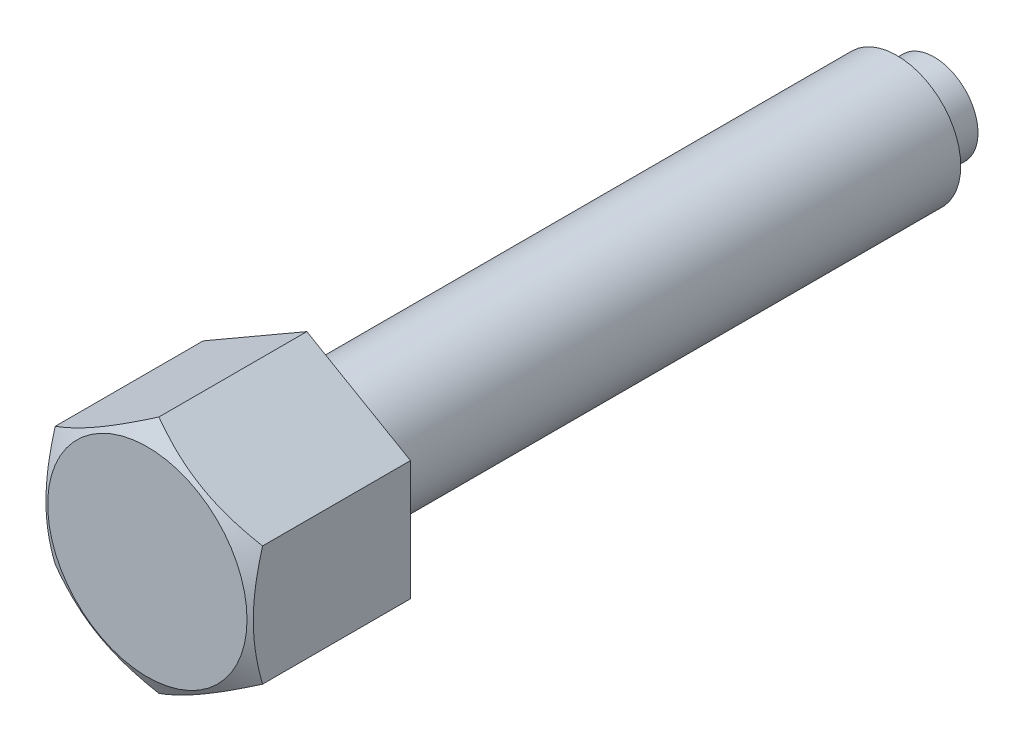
ISO-10303-21;
HEADER;
FILE_DESCRIPTION(('STEP AP214'),'2;1');
FILE_NAME('part.step','',(''),(''),'','','');
FILE_SCHEMA(('AUTOMOTIVE_DESIGN { 1 0 10303 214 1 1 1 1 }'));
ENDSEC;
DATA;
#1=APPLICATION_CONTEXT('core data for automotive mechanical design processes');
#2=APPLICATION_PROTOCOL_DEFINITION('international standard','automotive_design',2000,#1);
#3=PRODUCT_CONTEXT('',#1,'mechanical');
#4=PRODUCT('Part','Part','',(#3));
#5=PRODUCT_RELATED_PRODUCT_CATEGORY('part','',(#4));
#6=PRODUCT_DEFINITION_FORMATION('','',#4);
#7=PRODUCT_DEFINITION_CONTEXT('part definition',#1,'design');
#8=PRODUCT_DEFINITION('design','',#6,#7);
#9=PRODUCT_DEFINITION_SHAPE('','',#8);
#10=(LENGTH_UNIT() NAMED_UNIT(*) SI_UNIT(.MILLI.,.METRE.));
#11=(NAMED_UNIT(*) PLANE_ANGLE_UNIT() SI_UNIT($,.RADIAN.));
#12=(NAMED_UNIT(*) SI_UNIT($,.STERADIAN.) SOLID_ANGLE_UNIT());
#13=UNCERTAINTY_MEASURE_WITH_UNIT(LENGTH_MEASURE(1.E-05),#10,'distance_accuracy_value','');
#14=(GEOMETRIC_REPRESENTATION_CONTEXT(3) GLOBAL_UNCERTAINTY_ASSIGNED_CONTEXT((#13)) GLOBAL_UNIT_ASSIGNED_CONTEXT((#10,
#11,#12)) REPRESENTATION_CONTEXT('',''));
#15=CARTESIAN_POINT('',(0.,0.,0.));
#16=DIRECTION('',(0.,0.,1.));
#17=DIRECTION('',(1.,0.,0.));
#18=AXIS2_PLACEMENT_3D('',#15,#16,#17);
#19=CARTESIAN_POINT('',(0.,7.50555349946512,38.));
#20=DIRECTION('',(-0.5,-0.86602540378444,0.));
#21=DIRECTION('',(0.86602540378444,-0.5,0.));
#22=AXIS2_PLACEMENT_3D('',#19,#20,#21);
#23=PLANE('',#22);
#24=CARTESIAN_POINT('',(6.5002,3.75266127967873,49.2750391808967));
#25=CARTESIAN_POINT('',(6.35732254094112,3.8351516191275,49.3226580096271));
#26=CARTESIAN_POINT('',(6.21391236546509,3.91794952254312,49.3681157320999));
#27=CARTESIAN_POINT('',(5.92592736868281,4.08421773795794,49.4541137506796));
#28=CARTESIAN_POINT('',(5.78135207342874,4.16768832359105,49.4946519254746));
#29=CARTESIAN_POINT('',(5.34531134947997,4.41943655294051,49.6080914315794));
#30=CARTESIAN_POINT('',(5.05212471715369,4.58870793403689,49.6726146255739));
#31=CARTESIAN_POINT('',(4.61337625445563,4.84201947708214,49.7482758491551));
#32=CARTESIAN_POINT('',(4.46912536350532,4.92530276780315,49.7698295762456));
#33=CARTESIAN_POINT('',(4.17997178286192,5.09224566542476,49.8059721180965));
#34=CARTESIAN_POINT('',(4.03506915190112,5.17590523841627,49.8205615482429));
#35=CARTESIAN_POINT('',(3.74501222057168,5.34336968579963,49.8424036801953));
#36=CARTESIAN_POINT('',(3.59985839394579,5.42717428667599,49.8496647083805));
#37=CARTESIAN_POINT('',(3.30942466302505,5.59485627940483,49.8567021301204));
#38=CARTESIAN_POINT('',(3.16414476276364,5.6787336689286,49.8564787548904));
#39=CARTESIAN_POINT('',(2.76612405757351,5.90853103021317,49.8455789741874));
#40=CARTESIAN_POINT('',(2.51351353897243,6.05437578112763,49.8272806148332));
#41=CARTESIAN_POINT('',(2.00997032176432,6.34509659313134,49.7692560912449));
#42=CARTESIAN_POINT('',(1.75903939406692,6.48997163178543,49.7295100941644));
#43=CARTESIAN_POINT('',(1.25448277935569,6.78127752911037,49.6301565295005));
#44=CARTESIAN_POINT('',(1.0009207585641,6.92767163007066,49.5701280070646));
#45=CARTESIAN_POINT('',(0.497578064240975,7.21827667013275,49.4338874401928));
#46=CARTESIAN_POINT('',(0.247790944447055,7.36249133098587,49.357707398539));
#47=CARTESIAN_POINT('',(-0.000199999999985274,7.50566896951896,49.2750391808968));
#48=B_SPLINE_CURVE_WITH_KNOTS('',3,(#24,#25,#26,#27,#28,#29,#30,#31,#32,#33,#34,#35,#36,#37,#38,
#39,#40,#41,#42,#43,#44,#45,#46,#47),.UNSPECIFIED.,.F.,.F.,(4,2,2,2,2,2,2,2,2,2,2,4),(0.,
0.515105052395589,1.03043143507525,2.06322554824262,2.56697389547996,3.07067772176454,
3.57380860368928,4.07692394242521,4.9527935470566,5.82947446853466,6.72559912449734,
7.61996451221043),.UNSPECIFIED.);
#49=CARTESIAN_POINT('',(6.5,3.75277674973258,49.2751058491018));
#50=VERTEX_POINT('',#49);
#51=CARTESIAN_POINT('',(0.,7.50555349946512,49.2751058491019));
#52=VERTEX_POINT('',#51);
#53=EDGE_CURVE('E29',#50,#52,#48,.T.);
#54=ORIENTED_EDGE('',*,*,#53,.F.);
#55=DIRECTION('',(0.,0.,1.));
#56=VECTOR('',#55,1.);
#57=CARTESIAN_POINT('',(6.5,3.75277674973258,38.));
#58=LINE('',#57,#56);
#59=CARTESIAN_POINT('',(6.5,3.75277674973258,40.));
#60=VERTEX_POINT('',#59);
#61=EDGE_CURVE('E96',#60,#50,#58,.T.);
#62=ORIENTED_EDGE('',*,*,#61,.F.);
#63=DIRECTION('',(0.86602540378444,-0.5,0.));
#64=VECTOR('',#63,1.);
#65=CARTESIAN_POINT('',(6.25,3.89711431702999,40.));
#66=LINE('',#65,#64);
#67=CARTESIAN_POINT('',(0.,7.50555349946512,40.));
#68=VERTEX_POINT('',#67);
#69=EDGE_CURVE('E110',#68,#60,#66,.T.);
#70=ORIENTED_EDGE('',*,*,#69,.F.);
#71=DIRECTION('',(0.,0.,1.));
#72=VECTOR('',#71,1.);
#73=CARTESIAN_POINT('',(0.,7.50555349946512,38.));
#74=LINE('',#73,#72);
#75=EDGE_CURVE('E36',#68,#52,#74,.T.);
#76=ORIENTED_EDGE('',*,*,#75,.T.);
#77=EDGE_LOOP('',(#54,#62,#70,#76));
#78=FACE_BOUND('',#77,.T.);
#79=ADVANCED_FACE('F14',(#78),#23,.F.);
#80=CARTESIAN_POINT('',(6.5,3.75277674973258,38.));
#81=DIRECTION('',(-1.,0.,0.));
#82=DIRECTION('',(0.,-1.,0.));
#83=AXIS2_PLACEMENT_3D('',#80,#81,#82);
#84=PLANE('',#83);
#85=CARTESIAN_POINT('',(6.5,-10.0501735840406,46.6981572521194));
#86=CARTESIAN_POINT('',(6.5,-9.76652663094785,46.8356295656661));
#87=CARTESIAN_POINT('',(6.5,-9.48222527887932,46.9717749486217));
#88=CARTESIAN_POINT('',(6.5,-8.91196565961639,47.240664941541));
#89=CARTESIAN_POINT('',(6.5,-8.62600713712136,47.3734090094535));
#90=CARTESIAN_POINT('',(6.5,-8.05059717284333,47.6354237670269));
#91=CARTESIAN_POINT('',(6.5,-7.76113517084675,47.7646713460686));
#92=CARTESIAN_POINT('',(6.5,-7.17989822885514,48.0178366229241));
#93=CARTESIAN_POINT('',(6.5,-6.88812339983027,48.1417545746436));
#94=CARTESIAN_POINT('',(6.5,-6.29249929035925,48.3866756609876));
#95=CARTESIAN_POINT('',(6.5,-5.98856037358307,48.5074620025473));
#96=CARTESIAN_POINT('',(6.5,-5.37711520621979,48.7398195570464));
#97=CARTESIAN_POINT('',(6.5,-5.06960855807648,48.8513897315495));
#98=CARTESIAN_POINT('',(6.5,-4.45112530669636,49.0623641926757));
#99=CARTESIAN_POINT('',(6.5,-4.14015727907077,49.1617933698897));
#100=CARTESIAN_POINT('',(6.5,-3.51375753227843,49.3452742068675));
#101=CARTESIAN_POINT('',(6.5,-3.19832726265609,49.4293307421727));
#102=CARTESIAN_POINT('',(6.5,-2.56458296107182,49.5775713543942));
#103=CARTESIAN_POINT('',(6.5,-2.2462942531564,49.6418619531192));
#104=CARTESIAN_POINT('',(6.5,-1.60574569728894,49.7469001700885));
#105=CARTESIAN_POINT('',(6.5,-1.28348621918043,49.7876499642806));
#106=CARTESIAN_POINT('',(6.5,-0.800541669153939,49.8284124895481));
#107=CARTESIAN_POINT('',(6.5,-0.640675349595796,49.8386045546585));
#108=CARTESIAN_POINT('',(6.5,-0.320647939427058,49.8522269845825));
#109=CARTESIAN_POINT('',(6.5,-0.160486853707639,49.8556574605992));
#110=CARTESIAN_POINT('',(6.5,0.159835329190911,49.8556673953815));
#111=CARTESIAN_POINT('',(6.5,0.319996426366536,49.8522468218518));
#112=CARTESIAN_POINT('',(6.5,0.640033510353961,49.8386397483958));
#113=CARTESIAN_POINT('',(6.5,0.799909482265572,49.8284529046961));
#114=CARTESIAN_POINT('',(6.5,1.1850597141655,49.7959757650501));
#115=CARTESIAN_POINT('',(6.5,1.41006459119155,49.770423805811));
#116=CARTESIAN_POINT('',(6.5,1.85837391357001,49.7073182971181));
#117=CARTESIAN_POINT('',(6.5,2.08167811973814,49.6697630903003));
#118=CARTESIAN_POINT('',(6.5,2.74880133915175,49.5410865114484));
#119=CARTESIAN_POINT('',(6.5,3.18957588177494,49.4339785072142));
#120=CARTESIAN_POINT('',(6.5,3.84861504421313,49.2486258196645));
#121=CARTESIAN_POINT('',(6.5,4.07030760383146,49.1818718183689));
#122=CARTESIAN_POINT('',(6.5,4.51153880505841,49.0415258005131));
#123=CARTESIAN_POINT('',(6.5,4.73107743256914,48.9679337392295));
#124=CARTESIAN_POINT('',(6.5,5.16807170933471,48.815084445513));
#125=CARTESIAN_POINT('',(6.5,5.38552803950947,48.7358291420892));
#126=CARTESIAN_POINT('',(6.5,5.81864539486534,48.5725763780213));
#127=CARTESIAN_POINT('',(6.5,6.03430643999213,48.488578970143));
#128=CARTESIAN_POINT('',(6.5,6.53886111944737,48.2866902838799));
#129=CARTESIAN_POINT('',(6.5,6.8271062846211,48.1671814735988));
#130=CARTESIAN_POINT('',(6.5,7.40118486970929,47.9224889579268));
#131=CARTESIAN_POINT('',(6.5,7.68701814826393,47.7973049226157));
#132=CARTESIAN_POINT('',(6.5,8.25671090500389,47.5423894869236));
#133=CARTESIAN_POINT('',(6.5,8.54056998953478,47.4126572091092));
#134=CARTESIAN_POINT('',(6.5,9.10659576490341,47.1495453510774));
#135=CARTESIAN_POINT('',(6.5,9.38876242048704,47.0161656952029));
#136=CARTESIAN_POINT('',(6.5,9.9519638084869,46.7462996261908));
#137=CARTESIAN_POINT('',(6.5,10.2329970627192,46.6098101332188));
#138=CARTESIAN_POINT('',(6.5,10.7938615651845,46.3343812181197));
#139=CARTESIAN_POINT('',(6.5,11.0736928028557,46.1954417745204));
#140=CARTESIAN_POINT('',(6.5,11.9115962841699,45.7756296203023));
#141=CARTESIAN_POINT('',(6.5,12.4681508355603,45.4917280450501));
#142=CARTESIAN_POINT('',(6.5,13.5324754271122,44.9419038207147));
#143=CARTESIAN_POINT('',(6.5,14.0404794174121,44.6764320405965));
#144=CARTESIAN_POINT('',(6.5,15.0545974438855,44.141863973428));
#145=CARTESIAN_POINT('',(6.5,15.5607114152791,43.8727675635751));
#146=CARTESIAN_POINT('',(6.5,16.5702359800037,43.3324660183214));
#147=CARTESIAN_POINT('',(6.5,17.0736501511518,43.0612675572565));
#148=CARTESIAN_POINT('',(6.5,18.0792676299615,42.5166981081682));
#149=CARTESIAN_POINT('',(6.5,18.581471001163,42.2433272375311));
#150=CARTESIAN_POINT('',(6.5,19.0832274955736,41.9691440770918));
#151=B_SPLINE_CURVE_WITH_KNOTS('',3,(#85,#86,#87,#88,#89,#90,#91,#92,#93,#94,#95,#96,#97,#98,
#99,#100,#101,#102,#103,#104,#105,#106,#107,#108,#109,#110,#111,#112,#113,#114,#115,#116,#117,
#118,#119,#120,#121,#122,#123,#124,#125,#126,#127,#128,#129,#130,#131,#132,#133,#134,#135,#136,
#137,#138,#139,#140,#141,#142,#143,#144,#145,#146,#147,#148,#149,#150),.UNSPECIFIED.,.F.,.F.,(4,
2,2,2,2,2,2,2,2,2,2,2,2,2,2,2,2,2,2,2,2,2,2,2,2,2,2,2,2,2,2,2,4),(0.,0.945626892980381,
1.89140356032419,2.84238037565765,3.79331183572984,4.77437629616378,5.75555114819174,
6.73467943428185,7.71349664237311,8.6869424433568,9.66029825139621,10.1407496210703,
10.6211930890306,11.1016388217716,11.5821089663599,12.2610780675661,12.9401409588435,
14.2990319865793,14.9935493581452,15.6880712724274,16.3823577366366,17.0766364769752,
18.0126686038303,18.9487552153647,19.8850234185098,20.8213110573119,21.7585701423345,
22.6958374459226,24.5701304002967,26.2896757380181,28.0092794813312,29.7247241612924,
31.440076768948),.UNSPECIFIED.);
#152=CARTESIAN_POINT('',(6.5,-3.75277674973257,49.2751058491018));
#153=VERTEX_POINT('',#152);
#154=EDGE_CURVE('E156',#153,#50,#151,.T.);
#155=ORIENTED_EDGE('',*,*,#154,.F.);
#156=DIRECTION('',(0.,0.,1.));
#157=VECTOR('',#156,1.);
#158=CARTESIAN_POINT('',(6.5,-3.75277674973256,38.));
#159=LINE('',#158,#157);
#160=CARTESIAN_POINT('',(6.5,-3.75277674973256,40.));
#161=VERTEX_POINT('',#160);
#162=EDGE_CURVE('E93',#161,#153,#159,.T.);
#163=ORIENTED_EDGE('',*,*,#162,.F.);
#164=DIRECTION('',(0.,-1.,0.));
#165=VECTOR('',#164,1.);
#166=CARTESIAN_POINT('',(6.5,0.,40.));
#167=LINE('',#166,#165);
#168=EDGE_CURVE('E107',#60,#161,#167,.T.);
#169=ORIENTED_EDGE('',*,*,#168,.F.);
#170=ORIENTED_EDGE('',*,*,#61,.T.);
#171=EDGE_LOOP('',(#155,#163,#169,#170));
#172=FACE_BOUND('',#171,.T.);
#173=ADVANCED_FACE('F136',(#172),#84,.F.);
#174=CARTESIAN_POINT('',(0.,-7.50555349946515,38.));
#175=DIRECTION('',(0.5,-0.866025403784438,0.));
#176=DIRECTION('',(0.866025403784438,0.5,0.));
#177=AXIS2_PLACEMENT_3D('',#174,#175,#176);
#178=PLANE('',#177);
#179=ORIENTED_EDGE('',*,*,#162,.T.);
#180=CARTESIAN_POINT('',(6.5002,-3.75266127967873,49.2750391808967));
#181=CARTESIAN_POINT('',(6.35732254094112,-3.83515161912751,49.3226580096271));
#182=CARTESIAN_POINT('',(6.21391236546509,-3.91794952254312,49.3681157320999));
#183=CARTESIAN_POINT('',(5.92592736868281,-4.08421773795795,49.4541137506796));
#184=CARTESIAN_POINT('',(5.78135207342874,-4.16768832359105,49.4946519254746));
#185=CARTESIAN_POINT('',(5.34531134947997,-4.41943655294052,49.6080914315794));
#186=CARTESIAN_POINT('',(5.05212471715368,-4.5887079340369,49.6726146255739));
#187=CARTESIAN_POINT('',(4.61337625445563,-4.84201947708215,49.7482758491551));
#188=CARTESIAN_POINT('',(4.46912536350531,-4.92530276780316,49.7698295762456));
#189=CARTESIAN_POINT('',(4.17997178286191,-5.09224566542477,49.8059721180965));
#190=CARTESIAN_POINT('',(4.03506915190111,-5.17590523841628,49.8205615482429));
#191=CARTESIAN_POINT('',(3.74501222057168,-5.34336968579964,49.8424036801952));
#192=CARTESIAN_POINT('',(3.59985839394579,-5.427174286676,49.8496647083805));
#193=CARTESIAN_POINT('',(3.30942466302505,-5.59485627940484,49.8567021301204));
#194=CARTESIAN_POINT('',(3.16414476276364,-5.67873366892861,49.8564787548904));
#195=CARTESIAN_POINT('',(2.76612405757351,-5.90853103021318,49.8455789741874));
#196=CARTESIAN_POINT('',(2.51351353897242,-6.05437578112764,49.8272806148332));
#197=CARTESIAN_POINT('',(2.00997032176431,-6.34509659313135,49.7692560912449));
#198=CARTESIAN_POINT('',(1.75903939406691,-6.48997163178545,49.7295100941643));
#199=CARTESIAN_POINT('',(1.25448277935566,-6.7812775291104,49.6301565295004));
#200=CARTESIAN_POINT('',(1.00092075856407,-6.92767163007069,49.5701280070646));
#201=CARTESIAN_POINT('',(0.497578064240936,-7.21827667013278,49.4338874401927));
#202=CARTESIAN_POINT('',(0.247790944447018,-7.3624913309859,49.357707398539));
#203=CARTESIAN_POINT('',(-0.000200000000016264,-7.50566896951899,49.2750391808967));
#204=B_SPLINE_CURVE_WITH_KNOTS('',3,(#180,#181,#182,#183,#184,#185,#186,#187,#188,#189,#190,
#191,#192,#193,#194,#195,#196,#197,#198,#199,#200,#201,#202,#203),.UNSPECIFIED.,.F.,.F.,(4,2,2,
2,2,2,2,2,2,2,2,4),(0.,0.51510505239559,1.03043143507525,2.06322554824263,2.56697389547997,
3.07067772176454,3.57380860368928,4.07692394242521,4.95279354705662,5.82947446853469,
6.72559912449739,7.61996451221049),.UNSPECIFIED.);
#205=CARTESIAN_POINT('',(0.,-7.50555349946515,49.2751058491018));
#206=VERTEX_POINT('',#205);
#207=EDGE_CURVE('E162',#153,#206,#204,.T.);
#208=ORIENTED_EDGE('',*,*,#207,.T.);
#209=DIRECTION('',(0.,0.,1.));
#210=VECTOR('',#209,1.);
#211=CARTESIAN_POINT('',(0.,-7.50555349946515,38.));
#212=LINE('',#211,#210);
#213=CARTESIAN_POINT('',(0.,-7.50555349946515,40.));
#214=VERTEX_POINT('',#213);
#215=EDGE_CURVE('E86',#214,#206,#212,.T.);
#216=ORIENTED_EDGE('',*,*,#215,.F.);
#217=DIRECTION('',(0.866025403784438,0.5,0.));
#218=VECTOR('',#217,1.);
#219=CARTESIAN_POINT('',(6.25,-3.89711431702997,40.));
#220=LINE('',#219,#218);
#221=EDGE_CURVE('E105',#214,#161,#220,.T.);
#222=ORIENTED_EDGE('',*,*,#221,.T.);
#223=EDGE_LOOP('',(#179,#208,#216,#222));
#224=FACE_BOUND('',#223,.T.);
#225=ADVANCED_FACE('F142',(#224),#178,.T.);
#226=CARTESIAN_POINT('',(0.,-7.50555349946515,38.));
#227=DIRECTION('',(0.5,0.866025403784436,0.));
#228=DIRECTION('',(-0.866025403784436,0.5,0.));
#229=AXIS2_PLACEMENT_3D('',#226,#227,#228);
#230=PLANE('',#229);
#231=CARTESIAN_POINT('',(-6.5002,-3.75266127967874,49.2750391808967));
#232=CARTESIAN_POINT('',(-6.35732254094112,-3.83515161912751,49.3226580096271));
#233=CARTESIAN_POINT('',(-6.21391236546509,-3.91794952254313,49.3681157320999));
#234=CARTESIAN_POINT('',(-5.92592736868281,-4.08421773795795,49.4541137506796));
#235=CARTESIAN_POINT('',(-5.78135207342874,-4.16768832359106,49.4946519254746));
#236=CARTESIAN_POINT('',(-5.34531134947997,-4.41943655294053,49.6080914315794));
#237=CARTESIAN_POINT('',(-5.05212471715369,-4.58870793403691,49.6726146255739));
#238=CARTESIAN_POINT('',(-4.61337625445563,-4.84201947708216,49.7482758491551));
#239=CARTESIAN_POINT('',(-4.46912536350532,-4.92530276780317,49.7698295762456));
#240=CARTESIAN_POINT('',(-4.17997178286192,-5.09224566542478,49.8059721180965));
#241=CARTESIAN_POINT('',(-4.03506915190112,-5.17590523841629,49.8205615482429));
#242=CARTESIAN_POINT('',(-3.74501222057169,-5.34336968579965,49.8424036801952));
#243=CARTESIAN_POINT('',(-3.5998583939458,-5.42717428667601,49.8496647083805));
#244=CARTESIAN_POINT('',(-3.30942466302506,-5.59485627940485,49.8567021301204));
#245=CARTESIAN_POINT('',(-3.16414476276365,-5.67873366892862,49.8564787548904));
#246=CARTESIAN_POINT('',(-2.76612405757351,-5.90853103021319,49.8455789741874));
#247=CARTESIAN_POINT('',(-2.51351353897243,-6.05437578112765,49.8272806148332));
#248=CARTESIAN_POINT('',(-2.00997032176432,-6.34509659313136,49.7692560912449));
#249=CARTESIAN_POINT('',(-1.75903939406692,-6.48997163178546,49.7295100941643));
#250=CARTESIAN_POINT('',(-1.25448277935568,-6.7812775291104,49.6301565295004));
#251=CARTESIAN_POINT('',(-1.00092075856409,-6.92767163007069,49.5701280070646));
#252=CARTESIAN_POINT('',(-0.497578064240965,-7.21827667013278,49.4338874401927));
#253=CARTESIAN_POINT('',(-0.247790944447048,-7.3624913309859,49.357707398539));
#254=CARTESIAN_POINT('',(0.000199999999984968,-7.50566896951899,49.2750391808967));
#255=B_SPLINE_CURVE_WITH_KNOTS('',3,(#231,#232,#233,#234,#235,#236,#237,#238,#239,#240,#241,
#242,#243,#244,#245,#246,#247,#248,#249,#250,#251,#252,#253,#254),.UNSPECIFIED.,.F.,.F.,(4,2,2,
2,2,2,2,2,2,2,2,4),(0.,0.51510505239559,1.03043143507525,2.06322554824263,2.56697389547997,
3.07067772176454,3.57380860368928,4.07692394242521,4.95279354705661,5.82947446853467,
6.72559912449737,7.61996451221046),.UNSPECIFIED.);
#256=CARTESIAN_POINT('',(-6.5,-3.75277674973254,49.2751058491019));
#257=VERTEX_POINT('',#256);
#258=EDGE_CURVE('E80',#257,#206,#255,.T.);
#259=ORIENTED_EDGE('',*,*,#258,.F.);
#260=DIRECTION('',(0.,0.,1.));
#261=VECTOR('',#260,1.);
#262=CARTESIAN_POINT('',(-6.5,-3.75277674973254,38.));
#263=LINE('',#262,#261);
#264=CARTESIAN_POINT('',(-6.5,-3.75277674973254,40.));
#265=VERTEX_POINT('',#264);
#266=EDGE_CURVE('E79',#265,#257,#263,.T.);
#267=ORIENTED_EDGE('',*,*,#266,.F.);
#268=DIRECTION('',(-0.866025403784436,0.5,0.));
#269=VECTOR('',#268,1.);
#270=CARTESIAN_POINT('',(-0.250000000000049,-7.36121593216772,40.));
#271=LINE('',#270,#269);
#272=EDGE_CURVE('E102',#214,#265,#271,.T.);
#273=ORIENTED_EDGE('',*,*,#272,.F.);
#274=ORIENTED_EDGE('',*,*,#215,.T.);
#275=EDGE_LOOP('',(#259,#267,#273,#274));
#276=FACE_BOUND('',#275,.T.);
#277=ADVANCED_FACE('F238',(#276),#230,.F.);
#278=CARTESIAN_POINT('',(-6.5,3.75277674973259,38.));
#279=DIRECTION('',(-1.,0.,0.));
#280=DIRECTION('',(0.,-1.,0.));
#281=AXIS2_PLACEMENT_3D('',#278,#279,#280);
#282=PLANE('',#281);
#283=ORIENTED_EDGE('',*,*,#266,.T.);
#284=CARTESIAN_POINT('',(-6.5,-10.0501735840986,46.6981572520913));
#285=CARTESIAN_POINT('',(-6.5,-9.76652663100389,46.8356295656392));
#286=CARTESIAN_POINT('',(-6.5,-9.4822252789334,46.9717749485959));
#287=CARTESIAN_POINT('',(-6.5,-8.91196565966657,47.2406649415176));
#288=CARTESIAN_POINT('',(-6.5,-8.62600713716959,47.3734090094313));
#289=CARTESIAN_POINT('',(-6.5,-8.05059717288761,47.635423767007));
#290=CARTESIAN_POINT('',(-6.5,-7.76113517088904,47.7646713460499));
#291=CARTESIAN_POINT('',(-6.5,-7.17989822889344,48.0178366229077));
#292=CARTESIAN_POINT('',(-6.5,-6.88812339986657,48.1417545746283));
#293=CARTESIAN_POINT('',(-6.5,-6.2924992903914,48.3866756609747));
#294=CARTESIAN_POINT('',(-6.5,-5.98856037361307,48.5074620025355));
#295=CARTESIAN_POINT('',(-6.5,-5.37711520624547,48.739819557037));
#296=CARTESIAN_POINT('',(-6.5,-5.06960855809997,48.8513897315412));
#297=CARTESIAN_POINT('',(-6.5,-4.45112530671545,49.0623641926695));
#298=CARTESIAN_POINT('',(-6.5,-4.14015727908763,49.1617933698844));
#299=CARTESIAN_POINT('',(-6.5,-3.5137575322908,49.3452742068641));
#300=CARTESIAN_POINT('',(-6.5,-3.19832726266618,49.4293307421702));
#301=CARTESIAN_POINT('',(-6.5,-2.56458296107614,49.5775713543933));
#302=CARTESIAN_POINT('',(-6.5,-2.24629425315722,49.6418619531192));
#303=CARTESIAN_POINT('',(-6.5,-1.60574569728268,49.7469001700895));
#304=CARTESIAN_POINT('',(-6.5,-1.28348621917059,49.7876499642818));
#305=CARTESIAN_POINT('',(-6.5,-0.800541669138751,49.8284124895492));
#306=CARTESIAN_POINT('',(-6.5,-0.640675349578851,49.8386045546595));
#307=CARTESIAN_POINT('',(-6.5,-0.320647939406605,49.8522269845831));
#308=CARTESIAN_POINT('',(-6.5,-0.160486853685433,49.8556574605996));
#309=CARTESIAN_POINT('',(-6.5,0.159835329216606,49.8556673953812));
#310=CARTESIAN_POINT('',(-6.5,0.319996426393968,49.852246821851));
#311=CARTESIAN_POINT('',(-6.5,0.640033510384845,49.8386397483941));
#312=CARTESIAN_POINT('',(-6.5,0.799909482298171,49.8284529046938));
#313=CARTESIAN_POINT('',(-6.5,1.18505971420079,49.7959757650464));
#314=CARTESIAN_POINT('',(-6.5,1.41006459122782,49.7704238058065));
#315=CARTESIAN_POINT('',(-6.5,1.85837391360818,49.707318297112));
#316=CARTESIAN_POINT('',(-6.5,2.08167811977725,49.6697630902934));
#317=CARTESIAN_POINT('',(-6.5,2.7488013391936,49.541086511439));
#318=CARTESIAN_POINT('',(-6.5,3.18957588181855,49.4339785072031));
#319=CARTESIAN_POINT('',(-6.5,3.84861504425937,49.2486258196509));
#320=CARTESIAN_POINT('',(-6.5,4.07030760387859,49.1818718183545));
#321=CARTESIAN_POINT('',(-6.5,4.51153880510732,49.041525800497));
#322=CARTESIAN_POINT('',(-6.5,4.73107743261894,48.9679337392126));
#323=CARTESIAN_POINT('',(-6.5,5.16807170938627,48.8150844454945));
#324=CARTESIAN_POINT('',(-6.5,5.3855280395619,48.7358291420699));
#325=CARTESIAN_POINT('',(-6.5,5.81864539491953,48.5725763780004));
#326=CARTESIAN_POINT('',(-6.5,6.0343064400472,48.4885789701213));
#327=CARTESIAN_POINT('',(-6.5,6.53886111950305,48.2866902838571));
#328=CARTESIAN_POINT('',(-6.5,6.82710628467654,48.1671814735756));
#329=CARTESIAN_POINT('',(-6.5,7.40118486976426,47.9224889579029));
#330=CARTESIAN_POINT('',(-6.5,7.68701814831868,47.7973049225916));
#331=CARTESIAN_POINT('',(-6.5,8.25671090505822,47.5423894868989));
#332=CARTESIAN_POINT('',(-6.5,8.54056998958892,47.4126572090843));
#333=CARTESIAN_POINT('',(-6.5,9.10659576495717,47.1495453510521));
#334=CARTESIAN_POINT('',(-6.5,9.38876242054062,47.0161656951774));
#335=CARTESIAN_POINT('',(-6.5,9.95196380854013,46.746299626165));
#336=CARTESIAN_POINT('',(-6.5,10.2329970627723,46.6098101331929));
#337=CARTESIAN_POINT('',(-6.5,10.7938615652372,46.3343812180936));
#338=CARTESIAN_POINT('',(-6.5,11.0736928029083,46.1954417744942));
#339=CARTESIAN_POINT('',(-6.5,11.911596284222,45.7756296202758));
#340=CARTESIAN_POINT('',(-6.5,12.4681508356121,45.4917280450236));
#341=CARTESIAN_POINT('',(-6.5,13.5324754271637,44.9419038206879));
#342=CARTESIAN_POINT('',(-6.5,14.0404794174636,44.6764320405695));
#343=CARTESIAN_POINT('',(-6.5,15.0545974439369,44.1418639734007));
#344=CARTESIAN_POINT('',(-6.5,15.5607114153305,43.8727675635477));
#345=CARTESIAN_POINT('',(-6.5,16.5702359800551,43.3324660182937));
#346=CARTESIAN_POINT('',(-6.5,17.0736501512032,43.0612675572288));
#347=CARTESIAN_POINT('',(-6.5,18.079267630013,42.5166981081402));
#348=CARTESIAN_POINT('',(-6.5,18.5814710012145,42.243327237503));
#349=CARTESIAN_POINT('',(-6.5,19.0832274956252,41.9691440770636));
#350=B_SPLINE_CURVE_WITH_KNOTS('',3,(#284,#285,#286,#287,#288,#289,#290,#291,#292,#293,#294,
#295,#296,#297,#298,#299,#300,#301,#302,#303,#304,#305,#306,#307,#308,#309,#310,#311,#312,#313,
#314,#315,#316,#317,#318,#319,#320,#321,#322,#323,#324,#325,#326,#327,#328,#329,#330,#331,#332,
#333,#334,#335,#336,#337,#338,#339,#340,#341,#342,#343,#344,#345,#346,#347,#348,#349),
.UNSPECIFIED.,.F.,.F.,(4,2,2,2,2,2,2,2,2,2,2,2,2,2,2,2,2,2,2,2,2,2,2,2,2,2,2,2,2,2,2,2,4),(0.,
0.945626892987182,1.89140356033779,2.84238037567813,3.7933118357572,4.77437629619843,
5.75555114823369,6.73467943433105,7.71349664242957,8.68694244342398,9.66029825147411,
10.1407496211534,10.621193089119,11.1016388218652,11.5821089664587,12.2610780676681,
12.9401409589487,14.2990319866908,14.99354935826,15.6880712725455,16.3823577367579,
17.0766364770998,18.0126686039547,18.9487552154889,19.8850234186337,20.8213110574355,
21.7585701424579,22.6958374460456,24.5701304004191,26.2896757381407,28.0092794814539,
29.7247241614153,31.4400767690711),.UNSPECIFIED.);
#351=CARTESIAN_POINT('',(-6.5,3.75277674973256,49.2751058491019));
#352=VERTEX_POINT('',#351);
#353=EDGE_CURVE('E67',#257,#352,#350,.T.);
#354=ORIENTED_EDGE('',*,*,#353,.T.);
#355=DIRECTION('',(0.,0.,1.));
#356=VECTOR('',#355,1.);
#357=CARTESIAN_POINT('',(-6.5,3.75277674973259,38.));
#358=LINE('',#357,#356);
#359=CARTESIAN_POINT('',(-6.5,3.75277674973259,40.));
#360=VERTEX_POINT('',#359);
#361=EDGE_CURVE('E76',#360,#352,#358,.T.);
#362=ORIENTED_EDGE('',*,*,#361,.F.);
#363=DIRECTION('',(0.,-1.,0.));
#364=VECTOR('',#363,1.);
#365=CARTESIAN_POINT('',(-6.5,0.,40.));
#366=LINE('',#365,#364);
#367=EDGE_CURVE('E100',#360,#265,#366,.T.);
#368=ORIENTED_EDGE('',*,*,#367,.T.);
#369=EDGE_LOOP('',(#283,#354,#362,#368));
#370=FACE_BOUND('',#369,.T.);
#371=ADVANCED_FACE('F75',(#370),#282,.T.);
#372=CARTESIAN_POINT('',(0.,7.50555349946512,38.));
#373=DIRECTION('',(-0.5,0.866025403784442,0.));
#374=DIRECTION('',(-0.866025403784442,-0.5,0.));
#375=AXIS2_PLACEMENT_3D('',#372,#373,#374);
#376=PLANE('',#375);
#377=ORIENTED_EDGE('',*,*,#361,.T.);
#378=CARTESIAN_POINT('',(-6.5002,3.75266127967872,49.2750391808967));
#379=CARTESIAN_POINT('',(-6.35732254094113,3.83515161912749,49.3226580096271));
#380=CARTESIAN_POINT('',(-6.2139123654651,3.91794952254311,49.3681157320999));
#381=CARTESIAN_POINT('',(-5.92592736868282,4.08421773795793,49.4541137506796));
#382=CARTESIAN_POINT('',(-5.78135207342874,4.16768832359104,49.4946519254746));
#383=CARTESIAN_POINT('',(-5.34531134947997,4.4194365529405,49.6080914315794));
#384=CARTESIAN_POINT('',(-5.05212471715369,4.58870793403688,49.6726146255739));
#385=CARTESIAN_POINT('',(-4.61337625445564,4.84201947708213,49.7482758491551));
#386=CARTESIAN_POINT('',(-4.46912536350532,4.92530276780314,49.7698295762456));
#387=CARTESIAN_POINT('',(-4.17997178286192,5.09224566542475,49.8059721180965));
#388=CARTESIAN_POINT('',(-4.03506915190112,5.17590523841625,49.8205615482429));
#389=CARTESIAN_POINT('',(-3.74501222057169,5.34336968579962,49.8424036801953));
#390=CARTESIAN_POINT('',(-3.5998583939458,5.42717428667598,49.8496647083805));
#391=CARTESIAN_POINT('',(-3.30942466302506,5.59485627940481,49.8567021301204));
#392=CARTESIAN_POINT('',(-3.16414476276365,5.67873366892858,49.8564787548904));
#393=CARTESIAN_POINT('',(-2.76612405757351,5.90853103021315,49.8455789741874));
#394=CARTESIAN_POINT('',(-2.51351353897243,6.05437578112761,49.8272806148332));
#395=CARTESIAN_POINT('',(-2.00997032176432,6.34509659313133,49.7692560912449));
#396=CARTESIAN_POINT('',(-1.75903939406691,6.48997163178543,49.7295100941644));
#397=CARTESIAN_POINT('',(-1.25448277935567,6.78127752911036,49.6301565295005));
#398=CARTESIAN_POINT('',(-1.00092075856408,6.92767163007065,49.5701280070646));
#399=CARTESIAN_POINT('',(-0.497578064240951,7.21827667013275,49.4338874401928));
#400=CARTESIAN_POINT('',(-0.24779094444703,7.36249133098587,49.357707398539));
#401=CARTESIAN_POINT('',(0.000200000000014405,7.50566896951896,49.2750391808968));
#402=B_SPLINE_CURVE_WITH_KNOTS('',3,(#378,#379,#380,#381,#382,#383,#384,#385,#386,#387,#388,
#389,#390,#391,#392,#393,#394,#395,#396,#397,#398,#399,#400,#401),.UNSPECIFIED.,.F.,.F.,(4,2,2,
2,2,2,2,2,2,2,2,4),(0.,0.515105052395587,1.03043143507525,2.06322554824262,2.56697389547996,
3.07067772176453,3.57380860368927,4.0769239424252,4.9527935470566,5.82947446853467,
6.72559912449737,7.61996451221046),.UNSPECIFIED.);
#403=EDGE_CURVE('E64',#352,#52,#402,.T.);
#404=ORIENTED_EDGE('',*,*,#403,.T.);
#405=ORIENTED_EDGE('',*,*,#75,.F.);
#406=DIRECTION('',(-0.866025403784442,-0.5,0.));
#407=VECTOR('',#406,1.);
#408=CARTESIAN_POINT('',(-0.249999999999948,7.36121593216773,40.));
#409=LINE('',#408,#407);
#410=EDGE_CURVE('E84',#68,#360,#409,.T.);
#411=ORIENTED_EDGE('',*,*,#410,.T.);
#412=EDGE_LOOP('',(#377,#404,#405,#411));
#413=FACE_BOUND('',#412,.T.);
#414=ADVANCED_FACE('F82',(#413),#376,.T.);
#415=CARTESIAN_POINT('',(0.,0.,6.));
#416=DIRECTION('',(0.,0.,1.));
#417=DIRECTION('',(1.,0.,0.));
#418=AXIS2_PLACEMENT_3D('',#415,#416,#417);
#419=SPHERICAL_SURFACE('',#418,6.);
#420=CARTESIAN_POINT('',(0.,0.,0.667317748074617));
#421=DIRECTION('',(0.,0.,1.));
#422=DIRECTION('',(1.,0.,0.));
#423=AXIS2_PLACEMENT_3D('',#420,#421,#422);
#424=CIRCLE('',#423,2.75);
#425=CARTESIAN_POINT('',(2.75,0.,0.667317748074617));
#426=VERTEX_POINT('',#425);
#427=EDGE_CURVE('E9',#426,#426,#424,.T.);
#428=ORIENTED_EDGE('',*,*,#427,.F.);
#429=EDGE_LOOP('',(#428));
#430=FACE_BOUND('',#429,.T.);
#431=ADVANCED_FACE('F16',(#430),#419,.T.);
#432=CARTESIAN_POINT('',(0.,0.,110.));
#433=DIRECTION('',(0.,0.,1.));
#434=DIRECTION('',(1.,0.,0.));
#435=AXIS2_PLACEMENT_3D('',#432,#433,#434);
#436=CYLINDRICAL_SURFACE('',#435,2.75);
#437=ORIENTED_EDGE('',*,*,#427,.T.);
#438=EDGE_LOOP('',(#437));
#439=FACE_BOUND('',#438,.T.);
#440=CARTESIAN_POINT('',(0.,0.,3.));
#441=DIRECTION('',(0.,0.,1.));
#442=DIRECTION('',(1.,0.,0.));
#443=AXIS2_PLACEMENT_3D('',#440,#441,#442);
#444=CIRCLE('',#443,2.75);
#445=CARTESIAN_POINT('',(2.75,0.,3.));
#446=VERTEX_POINT('',#445);
#447=EDGE_CURVE('E22',#446,#446,#444,.T.);
#448=ORIENTED_EDGE('',*,*,#447,.F.);
#449=EDGE_LOOP('',(#448));
#450=FACE_BOUND('',#449,.T.);
#451=ADVANCED_FACE('F123',(#439,#450),#436,.T.);
#452=CARTESIAN_POINT('',(2.75,0.,3.));
#453=DIRECTION('',(0.,0.,1.));
#454=DIRECTION('',(1.,0.,0.));
#455=AXIS2_PLACEMENT_3D('',#452,#453,#454);
#456=PLANE('',#455);
#457=CARTESIAN_POINT('',(0.,0.,3.));
#458=DIRECTION('',(0.,0.,1.));
#459=DIRECTION('',(1.,0.,0.));
#460=AXIS2_PLACEMENT_3D('',#457,#458,#459);
#461=CIRCLE('',#460,4.);
#462=CARTESIAN_POINT('',(4.,0.,3.));
#463=VERTEX_POINT('',#462);
#464=EDGE_CURVE('E116',#463,#463,#461,.T.);
#465=ORIENTED_EDGE('',*,*,#464,.F.);
#466=EDGE_LOOP('',(#465));
#467=FACE_BOUND('',#466,.T.);
#468=ORIENTED_EDGE('',*,*,#447,.T.);
#469=EDGE_LOOP('',(#468));
#470=FACE_BOUND('',#469,.T.);
#471=ADVANCED_FACE('F121',(#467,#470),#456,.F.);
#472=CARTESIAN_POINT('',(0.,0.,110.));
#473=DIRECTION('',(0.,0.,1.));
#474=DIRECTION('',(1.,0.,0.));
#475=AXIS2_PLACEMENT_3D('',#472,#473,#474);
#476=CYLINDRICAL_SURFACE('',#475,4.);
#477=CARTESIAN_POINT('',(0.,0.,40.));
#478=DIRECTION('',(0.,0.,1.));
#479=DIRECTION('',(1.,0.,0.));
#480=AXIS2_PLACEMENT_3D('',#477,#478,#479);
#481=CIRCLE('',#480,4.);
#482=CARTESIAN_POINT('',(4.,0.,40.));
#483=VERTEX_POINT('',#482);
#484=EDGE_CURVE('E113',#483,#483,#481,.T.);
#485=ORIENTED_EDGE('',*,*,#484,.F.);
#486=EDGE_LOOP('',(#485));
#487=FACE_BOUND('',#486,.T.);
#488=ORIENTED_EDGE('',*,*,#464,.T.);
#489=EDGE_LOOP('',(#488));
#490=FACE_BOUND('',#489,.T.);
#491=ADVANCED_FACE('F131',(#487,#490),#476,.T.);
#492=CARTESIAN_POINT('',(4.,0.,40.));
#493=DIRECTION('',(0.,0.,1.));
#494=DIRECTION('',(1.,0.,0.));
#495=AXIS2_PLACEMENT_3D('',#492,#493,#494);
#496=PLANE('',#495);
#497=ORIENTED_EDGE('',*,*,#410,.F.);
#498=ORIENTED_EDGE('',*,*,#69,.T.);
#499=ORIENTED_EDGE('',*,*,#168,.T.);
#500=ORIENTED_EDGE('',*,*,#221,.F.);
#501=ORIENTED_EDGE('',*,*,#272,.T.);
#502=ORIENTED_EDGE('',*,*,#367,.F.);
#503=EDGE_LOOP('',(#497,#498,#499,#500,#501,#502));
#504=FACE_BOUND('',#503,.T.);
#505=ORIENTED_EDGE('',*,*,#484,.T.);
#506=EDGE_LOOP('',(#505));
#507=FACE_BOUND('',#506,.T.);
#508=ADVANCED_FACE('F177',(#504,#507),#496,.F.);
#509=CARTESIAN_POINT('',(0.,0.,50.));
#510=DIRECTION('',(0.,0.,-1.));
#511=DIRECTION('',(-1.,0.,0.));
#512=AXIS2_PLACEMENT_3D('',#509,#510,#511);
#513=CONICAL_SURFACE('',#512,6.25,1.0471975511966);
#514=CARTESIAN_POINT('',(0.,0.,50.));
#515=DIRECTION('',(0.,0.,1.));
#516=DIRECTION('',(1.,0.,0.));
#517=AXIS2_PLACEMENT_3D('',#514,#515,#516);
#518=CIRCLE('',#517,6.25);
#519=CARTESIAN_POINT('',(6.25,0.,50.));
#520=VERTEX_POINT('',#519);
#521=EDGE_CURVE('E70',#520,#520,#518,.T.);
#522=ORIENTED_EDGE('',*,*,#521,.F.);
#523=EDGE_LOOP('',(#522));
#524=FACE_BOUND('',#523,.T.);
#525=ORIENTED_EDGE('',*,*,#53,.T.);
#526=ORIENTED_EDGE('',*,*,#403,.F.);
#527=ORIENTED_EDGE('',*,*,#353,.F.);
#528=ORIENTED_EDGE('',*,*,#258,.T.);
#529=ORIENTED_EDGE('',*,*,#207,.F.);
#530=ORIENTED_EDGE('',*,*,#154,.T.);
#531=EDGE_LOOP('',(#525,#526,#527,#528,#529,#530));
#532=FACE_BOUND('',#531,.T.);
#533=ADVANCED_FACE('F66',(#524,#532),#513,.T.);
#534=CARTESIAN_POINT('',(0.,0.,50.));
#535=DIRECTION('',(0.,0.,1.));
#536=DIRECTION('',(1.,0.,0.));
#537=AXIS2_PLACEMENT_3D('',#534,#535,#536);
#538=PLANE('',#537);
#539=ORIENTED_EDGE('',*,*,#521,.T.);
#540=EDGE_LOOP('',(#539));
#541=FACE_BOUND('',#540,.T.);
#542=ADVANCED_FACE('F173',(#541),#538,.T.);
#543=CLOSED_SHELL('',(#79,#173,#225,#277,#371,#414,#431,#451,#471,#491,#508,#533,#542));
#544=MANIFOLD_SOLID_BREP('B1',#543);
#545=ADVANCED_BREP_SHAPE_REPRESENTATION('',(#18,#544),#14);
#546=SHAPE_DEFINITION_REPRESENTATION(#9,#545);
ENDSEC;
END-ISO-10303-21;
